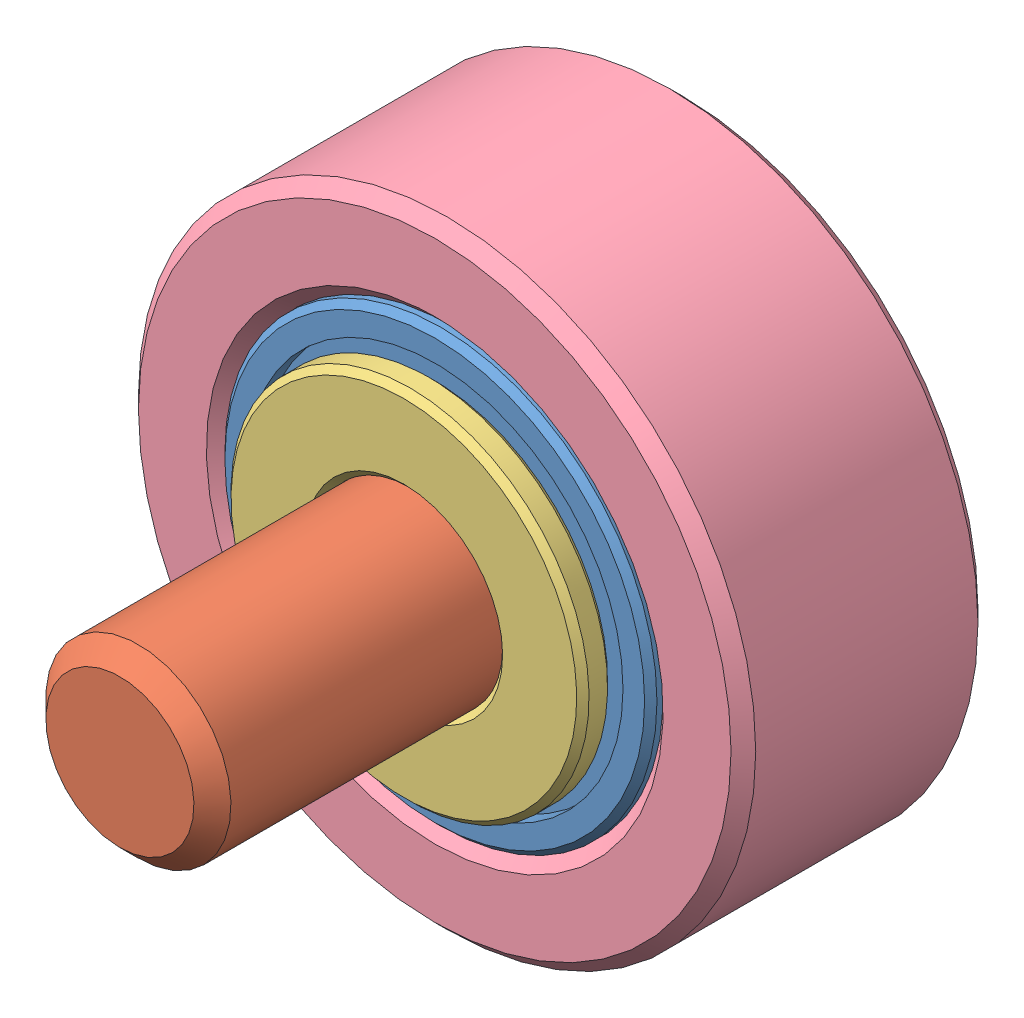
SolidWorks assembly transmission_belt_tensioner.SLDASM, configuration Standard (file format 10000). Lengths in mm.
Overall size (10 10 10).
4 component instances, 4 part files, 6 mates.
Components (placement in the parent):
- bearing_7_3_3_sbn_683_2ZVA-1: bearing_7_3_3_sbn_683_2ZVA.SLDPRT [Standard] at origin size (7 7 3)
- fastener_fhs_m3_10-1: fastener_fhs_m3_10.SLDPRT [Standard] at (0 0 -3.4) x (0.710944 -0.703248 0) z (0 0 -1) size (5.8 5.8 10)
- fastener_washer_m2.5-1: fastener_washer_m2.5.SLDPRT [Standard] at (0 0 2) x (1 0 0) z (0 1 0) size (5.8 0.5 5.8)
- transmission_belt_tensioner_roller-1: transmission_belt_tensioner_roller.SLDPRT [Standard] at (0 0 -0.5) x (1 0 0) z (0 1 0) size (10 4 10)
Mates (geometry in assembly coordinates):
- Deckungsgleich1: coincident aligned: line of bearing_7_3_3_sbn_683_2ZVA-1 through (0 0 -1.65) axis (0 0 1); line of fastener_fhs_m3_10-1 through (0 0 -3.9) axis (0 0 1)
- Deckungsgleich2: coincident: circle of bearing_7_3_3_sbn_683_2ZVA-1; cone of fastener_fhs_m3_10-1 through (0 0 -1.4) axis (0 0 1)
- Deckungsgleich3: coincident anti-aligned: line of bearing_7_3_3_sbn_683_2ZVA-1 through (0 0 -1.65) axis (0 0 1); line of fastener_washer_m2.5-1 through (0 0 2.03) axis (0 0 -1)
- Deckungsgleich4: coincident anti-aligned: plane of bearing_7_3_3_sbn_683_2ZVA-1 through (0 1.5 1.5) normal (0 0 1); plane of fastener_washer_m2.5-1 through (0 0 1.5) normal (0 0 -1)
- Deckungsgleich5: coincident anti-aligned: line of bearing_7_3_3_sbn_683_2ZVA-1 through (0 0 -1.65) axis (0 0 1); line of transmission_belt_tensioner_roller-1 through (0 0 13.9494) axis (0 0 -1)
- Deckungsgleich6: coincident anti-aligned: plane of bearing_7_3_3_sbn_683_2ZVA-1 through (0 3.05 -1.5) normal (0 0 -1); plane of transmission_belt_tensioner_roller-1 through (0 -3.5 -1.5) normal (0 0 1)
